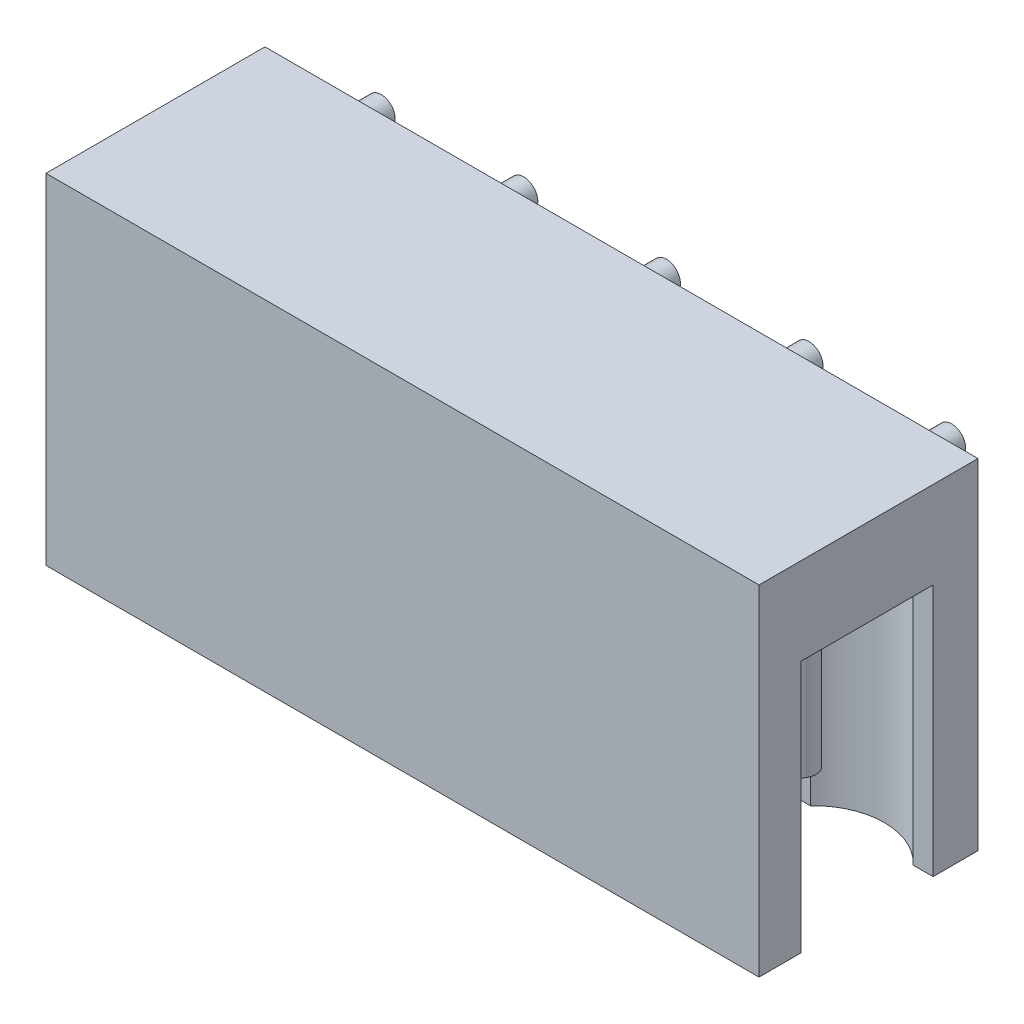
ISO-10303-21;
HEADER;
FILE_DESCRIPTION(('STEP AP214'),'2;1');
FILE_NAME('part.step','',(''),(''),'','','');
FILE_SCHEMA(('AUTOMOTIVE_DESIGN { 1 0 10303 214 1 1 1 1 }'));
ENDSEC;
DATA;
#1=APPLICATION_CONTEXT('core data for automotive mechanical design processes');
#2=APPLICATION_PROTOCOL_DEFINITION('international standard','automotive_design',2000,#1);
#3=PRODUCT_CONTEXT('',#1,'mechanical');
#4=PRODUCT('Part','Part','',(#3));
#5=PRODUCT_RELATED_PRODUCT_CATEGORY('part','',(#4));
#6=PRODUCT_DEFINITION_FORMATION('','',#4);
#7=PRODUCT_DEFINITION_CONTEXT('part definition',#1,'design');
#8=PRODUCT_DEFINITION('design','',#6,#7);
#9=PRODUCT_DEFINITION_SHAPE('','',#8);
#10=(LENGTH_UNIT() NAMED_UNIT(*) SI_UNIT(.MILLI.,.METRE.));
#11=(NAMED_UNIT(*) PLANE_ANGLE_UNIT() SI_UNIT($,.RADIAN.));
#12=(NAMED_UNIT(*) SI_UNIT($,.STERADIAN.) SOLID_ANGLE_UNIT());
#13=UNCERTAINTY_MEASURE_WITH_UNIT(LENGTH_MEASURE(1.E-05),#10,'distance_accuracy_value','');
#14=(GEOMETRIC_REPRESENTATION_CONTEXT(3) GLOBAL_UNCERTAINTY_ASSIGNED_CONTEXT((#13)) GLOBAL_UNIT_ASSIGNED_CONTEXT((#10,
#11,#12)) REPRESENTATION_CONTEXT('',''));
#15=CARTESIAN_POINT('',(0.,0.,0.));
#16=DIRECTION('',(0.,0.,1.));
#17=DIRECTION('',(1.,0.,0.));
#18=AXIS2_PLACEMENT_3D('',#15,#16,#17);
#19=CARTESIAN_POINT('',(0.,0.,7.8));
#20=DIRECTION('',(0.,1.,0.));
#21=DIRECTION('',(0.,0.,1.));
#22=AXIS2_PLACEMENT_3D('',#19,#20,#21);
#23=PLANE('',#22);
#24=DIRECTION('',(0.,0.,-1.));
#25=VECTOR('',#24,1.);
#26=CARTESIAN_POINT('',(0.,0.,7.8));
#27=LINE('',#26,#25);
#28=CARTESIAN_POINT('',(0.,0.,7.8));
#29=VERTEX_POINT('',#28);
#30=CARTESIAN_POINT('',(0.,0.,6.3));
#31=VERTEX_POINT('',#30);
#32=EDGE_CURVE('E11',#29,#31,#27,.T.);
#33=ORIENTED_EDGE('',*,*,#32,.T.);
#34=DIRECTION('',(-1.,0.,0.));
#35=VECTOR('',#34,1.);
#36=CARTESIAN_POINT('',(25.4,0.,6.3));
#37=LINE('',#36,#35);
#38=CARTESIAN_POINT('',(25.4,0.,6.3));
#39=VERTEX_POINT('',#38);
#40=EDGE_CURVE('E234',#39,#31,#37,.T.);
#41=ORIENTED_EDGE('',*,*,#40,.F.);
#42=DIRECTION('',(0.,0.,-1.));
#43=VECTOR('',#42,1.);
#44=CARTESIAN_POINT('',(25.4,0.,7.8));
#45=LINE('',#44,#43);
#46=CARTESIAN_POINT('',(25.4,0.,7.8));
#47=VERTEX_POINT('',#46);
#48=EDGE_CURVE('E334',#47,#39,#45,.T.);
#49=ORIENTED_EDGE('',*,*,#48,.F.);
#50=DIRECTION('',(1.,0.,0.));
#51=VECTOR('',#50,1.);
#52=CARTESIAN_POINT('',(0.,0.,7.8));
#53=LINE('',#52,#51);
#54=EDGE_CURVE('E87',#29,#47,#53,.T.);
#55=ORIENTED_EDGE('',*,*,#54,.F.);
#56=EDGE_LOOP('',(#33,#41,#49,#55));
#57=FACE_BOUND('',#56,.T.);
#58=ADVANCED_FACE('F35',(#57),#23,.F.);
#59=CARTESIAN_POINT('',(0.,0.,7.8));
#60=DIRECTION('',(1.,0.,0.));
#61=DIRECTION('',(0.,0.,-1.));
#62=AXIS2_PLACEMENT_3D('',#59,#60,#61);
#63=PLANE('',#62);
#64=CARTESIAN_POINT('',(0.,0.,1.6));
#65=VERTEX_POINT('',#64);
#66=CARTESIAN_POINT('',(0.,0.,0.));
#67=VERTEX_POINT('',#66);
#68=EDGE_CURVE('E43',#65,#67,#27,.T.);
#69=ORIENTED_EDGE('',*,*,#68,.F.);
#70=DIRECTION('',(0.,-1.,0.));
#71=VECTOR('',#70,1.);
#72=CARTESIAN_POINT('',(0.,9.,1.6));
#73=LINE('',#72,#71);
#74=CARTESIAN_POINT('',(0.,9.,1.6));
#75=VERTEX_POINT('',#74);
#76=EDGE_CURVE('E278',#75,#65,#73,.T.);
#77=ORIENTED_EDGE('',*,*,#76,.F.);
#78=DIRECTION('',(0.,0.,-1.));
#79=VECTOR('',#78,1.);
#80=CARTESIAN_POINT('',(0.,9.,6.3));
#81=LINE('',#80,#79);
#82=CARTESIAN_POINT('',(0.,9.,6.3));
#83=VERTEX_POINT('',#82);
#84=EDGE_CURVE('E203',#83,#75,#81,.T.);
#85=ORIENTED_EDGE('',*,*,#84,.F.);
#86=DIRECTION('',(0.,-1.,0.));
#87=VECTOR('',#86,1.);
#88=CARTESIAN_POINT('',(0.,9.,6.3));
#89=LINE('',#88,#87);
#90=EDGE_CURVE('E280',#83,#31,#89,.T.);
#91=ORIENTED_EDGE('',*,*,#90,.T.);
#92=ORIENTED_EDGE('',*,*,#32,.F.);
#93=DIRECTION('',(0.,-1.,0.));
#94=VECTOR('',#93,1.);
#95=CARTESIAN_POINT('',(0.,0.,7.8));
#96=LINE('',#95,#94);
#97=CARTESIAN_POINT('',(0.,12.1,7.8));
#98=VERTEX_POINT('',#97);
#99=EDGE_CURVE('E316',#98,#29,#96,.T.);
#100=ORIENTED_EDGE('',*,*,#99,.F.);
#101=DIRECTION('',(0.,0.,-1.));
#102=VECTOR('',#101,1.);
#103=CARTESIAN_POINT('',(0.,12.1,7.8));
#104=LINE('',#103,#102);
#105=CARTESIAN_POINT('',(0.,12.1,0.));
#106=VERTEX_POINT('',#105);
#107=EDGE_CURVE('E322',#98,#106,#104,.T.);
#108=ORIENTED_EDGE('',*,*,#107,.T.);
#109=DIRECTION('',(0.,-1.,0.));
#110=VECTOR('',#109,1.);
#111=CARTESIAN_POINT('',(0.,0.,0.));
#112=LINE('',#111,#110);
#113=EDGE_CURVE('E313',#106,#67,#112,.T.);
#114=ORIENTED_EDGE('',*,*,#113,.T.);
#115=EDGE_LOOP('',(#69,#77,#85,#91,#92,#100,#108,#114));
#116=FACE_BOUND('',#115,.T.);
#117=ADVANCED_FACE('F37',(#116),#63,.F.);
#118=CARTESIAN_POINT('',(2.54,0.,3.29999999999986));
#119=DIRECTION('',(0.,-1.,0.));
#120=DIRECTION('',(0.,0.,-1.));
#121=AXIS2_PLACEMENT_3D('',#118,#119,#120);
#122=CIRCLE('',#121,2.5);
#123=CARTESIAN_POINT('',(0.706969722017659,0.,1.59999999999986));
#124=VERTEX_POINT('',#123);
#125=CARTESIAN_POINT('',(4.37303027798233,0.,1.59999999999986));
#126=VERTEX_POINT('',#125);
#127=EDGE_CURVE('E239',#124,#126,#122,.T.);
#128=ORIENTED_EDGE('',*,*,#127,.F.);
#129=DIRECTION('',(1.,0.,-2.00286942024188E-13));
#130=VECTOR('',#129,1.);
#131=CARTESIAN_POINT('',(0.,0.,1.6));
#132=LINE('',#131,#130);
#133=EDGE_CURVE('E236',#65,#124,#132,.T.);
#134=ORIENTED_EDGE('',*,*,#133,.F.);
#135=ORIENTED_EDGE('',*,*,#68,.T.);
#136=DIRECTION('',(1.,0.,0.));
#137=VECTOR('',#136,1.);
#138=CARTESIAN_POINT('',(0.,0.,0.));
#139=LINE('',#138,#137);
#140=CARTESIAN_POINT('',(25.4,0.,0.));
#141=VERTEX_POINT('',#140);
#142=EDGE_CURVE('E325',#67,#141,#139,.T.);
#143=ORIENTED_EDGE('',*,*,#142,.T.);
#144=CARTESIAN_POINT('',(25.4,0.,1.6));
#145=VERTEX_POINT('',#144);
#146=EDGE_CURVE('E333',#145,#141,#45,.T.);
#147=ORIENTED_EDGE('',*,*,#146,.F.);
#148=DIRECTION('',(1.,0.,0.));
#149=VECTOR('',#148,1.);
#150=CARTESIAN_POINT('',(24.6930302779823,0.,1.6));
#151=LINE('',#150,#149);
#152=CARTESIAN_POINT('',(24.6930302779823,0.,1.6));
#153=VERTEX_POINT('',#152);
#154=EDGE_CURVE('E231',#153,#145,#151,.T.);
#155=ORIENTED_EDGE('',*,*,#154,.F.);
#156=CARTESIAN_POINT('',(22.86,0.,3.3));
#157=DIRECTION('',(0.,-1.,0.));
#158=DIRECTION('',(0.,0.,-1.));
#159=AXIS2_PLACEMENT_3D('',#156,#157,#158);
#160=CIRCLE('',#159,2.5);
#161=CARTESIAN_POINT('',(21.0269697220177,0.,1.6));
#162=VERTEX_POINT('',#161);
#163=EDGE_CURVE('E176',#162,#153,#160,.T.);
#164=ORIENTED_EDGE('',*,*,#163,.F.);
#165=DIRECTION('',(1.,0.,0.));
#166=VECTOR('',#165,1.);
#167=CARTESIAN_POINT('',(19.6130302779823,0.,1.59999999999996));
#168=LINE('',#167,#166);
#169=CARTESIAN_POINT('',(19.6130302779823,0.,1.59999999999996));
#170=VERTEX_POINT('',#169);
#171=EDGE_CURVE('E190',#170,#162,#168,.T.);
#172=ORIENTED_EDGE('',*,*,#171,.F.);
#173=CARTESIAN_POINT('',(17.78,0.,3.29999999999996));
#174=DIRECTION('',(0.,-1.,0.));
#175=DIRECTION('',(0.,0.,-1.));
#176=AXIS2_PLACEMENT_3D('',#173,#174,#175);
#177=CIRCLE('',#176,2.5);
#178=CARTESIAN_POINT('',(15.9469697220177,0.,1.59999999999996));
#179=VERTEX_POINT('',#178);
#180=EDGE_CURVE('E193',#179,#170,#177,.T.);
#181=ORIENTED_EDGE('',*,*,#180,.F.);
#182=DIRECTION('',(1.,0.,0.));
#183=VECTOR('',#182,1.);
#184=CARTESIAN_POINT('',(14.5330302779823,0.,1.59999999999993));
#185=LINE('',#184,#183);
#186=CARTESIAN_POINT('',(14.5330302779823,0.,1.59999999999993));
#187=VERTEX_POINT('',#186);
#188=EDGE_CURVE('E254',#187,#179,#185,.T.);
#189=ORIENTED_EDGE('',*,*,#188,.F.);
#190=CARTESIAN_POINT('',(12.7,0.,3.29999999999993));
#191=DIRECTION('',(0.,-1.,0.));
#192=DIRECTION('',(0.,0.,-1.));
#193=AXIS2_PLACEMENT_3D('',#190,#191,#192);
#194=CIRCLE('',#193,2.5);
#195=CARTESIAN_POINT('',(10.8669697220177,0.,1.59999999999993));
#196=VERTEX_POINT('',#195);
#197=EDGE_CURVE('E251',#196,#187,#194,.T.);
#198=ORIENTED_EDGE('',*,*,#197,.F.);
#199=DIRECTION('',(1.,0.,0.));
#200=VECTOR('',#199,1.);
#201=CARTESIAN_POINT('',(9.45303027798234,0.,1.59999999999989));
#202=LINE('',#201,#200);
#203=CARTESIAN_POINT('',(9.45303027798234,0.,1.59999999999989));
#204=VERTEX_POINT('',#203);
#205=EDGE_CURVE('E248',#204,#196,#202,.T.);
#206=ORIENTED_EDGE('',*,*,#205,.F.);
#207=CARTESIAN_POINT('',(7.62,0.,3.29999999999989));
#208=DIRECTION('',(0.,-1.,0.));
#209=DIRECTION('',(0.,0.,-1.));
#210=AXIS2_PLACEMENT_3D('',#207,#208,#209);
#211=CIRCLE('',#210,2.5);
#212=CARTESIAN_POINT('',(5.78696972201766,0.,1.59999999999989));
#213=VERTEX_POINT('',#212);
#214=EDGE_CURVE('E245',#213,#204,#211,.T.);
#215=ORIENTED_EDGE('',*,*,#214,.F.);
#216=DIRECTION('',(1.,0.,0.));
#217=VECTOR('',#216,1.);
#218=CARTESIAN_POINT('',(4.37303027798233,0.,1.59999999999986));
#219=LINE('',#218,#217);
#220=EDGE_CURVE('E242',#126,#213,#219,.T.);
#221=ORIENTED_EDGE('',*,*,#220,.F.);
#222=EDGE_LOOP('',(#128,#134,#135,#143,#147,#155,#164,#172,#181,#189,#198,#206,#215,#221));
#223=FACE_BOUND('',#222,.T.);
#224=ADVANCED_FACE('F346',(#223),#23,.F.);
#225=CARTESIAN_POINT('',(25.4,0.,7.8));
#226=DIRECTION('',(-1.,0.,0.));
#227=DIRECTION('',(0.,0.,1.));
#228=AXIS2_PLACEMENT_3D('',#225,#226,#227);
#229=PLANE('',#228);
#230=ORIENTED_EDGE('',*,*,#48,.T.);
#231=DIRECTION('',(0.,-1.,0.));
#232=VECTOR('',#231,1.);
#233=CARTESIAN_POINT('',(25.4,9.,6.3));
#234=LINE('',#233,#232);
#235=CARTESIAN_POINT('',(25.4,9.,6.3));
#236=VERTEX_POINT('',#235);
#237=EDGE_CURVE('E283',#236,#39,#234,.T.);
#238=ORIENTED_EDGE('',*,*,#237,.F.);
#239=DIRECTION('',(0.,0.,1.));
#240=VECTOR('',#239,1.);
#241=CARTESIAN_POINT('',(25.4,9.,1.6));
#242=LINE('',#241,#240);
#243=CARTESIAN_POINT('',(25.4,9.,1.6));
#244=VERTEX_POINT('',#243);
#245=EDGE_CURVE('E185',#244,#236,#242,.T.);
#246=ORIENTED_EDGE('',*,*,#245,.F.);
#247=DIRECTION('',(0.,-1.,0.));
#248=VECTOR('',#247,1.);
#249=CARTESIAN_POINT('',(25.4,9.,1.6));
#250=LINE('',#249,#248);
#251=EDGE_CURVE('E179',#244,#145,#250,.T.);
#252=ORIENTED_EDGE('',*,*,#251,.T.);
#253=ORIENTED_EDGE('',*,*,#146,.T.);
#254=DIRECTION('',(0.,1.,0.));
#255=VECTOR('',#254,1.);
#256=CARTESIAN_POINT('',(25.4,0.,0.));
#257=LINE('',#256,#255);
#258=CARTESIAN_POINT('',(25.4,12.1,0.));
#259=VERTEX_POINT('',#258);
#260=EDGE_CURVE('E328',#141,#259,#257,.T.);
#261=ORIENTED_EDGE('',*,*,#260,.T.);
#262=DIRECTION('',(0.,0.,-1.));
#263=VECTOR('',#262,1.);
#264=CARTESIAN_POINT('',(25.4,12.1,7.8));
#265=LINE('',#264,#263);
#266=CARTESIAN_POINT('',(25.4,12.1,7.8));
#267=VERTEX_POINT('',#266);
#268=EDGE_CURVE('E332',#267,#259,#265,.T.);
#269=ORIENTED_EDGE('',*,*,#268,.F.);
#270=DIRECTION('',(0.,1.,0.));
#271=VECTOR('',#270,1.);
#272=CARTESIAN_POINT('',(25.4,0.,7.8));
#273=LINE('',#272,#271);
#274=EDGE_CURVE('E319',#47,#267,#273,.T.);
#275=ORIENTED_EDGE('',*,*,#274,.F.);
#276=EDGE_LOOP('',(#230,#238,#246,#252,#253,#261,#269,#275));
#277=FACE_BOUND('',#276,.T.);
#278=ADVANCED_FACE('F340',(#277),#229,.F.);
#279=CARTESIAN_POINT('',(0.,12.1,7.8));
#280=DIRECTION('',(0.,-1.,0.));
#281=DIRECTION('',(0.,0.,-1.));
#282=AXIS2_PLACEMENT_3D('',#279,#280,#281);
#283=PLANE('',#282);
#284=DIRECTION('',(-1.,0.,0.));
#285=VECTOR('',#284,1.);
#286=CARTESIAN_POINT('',(0.,12.1,0.));
#287=LINE('',#286,#285);
#288=EDGE_CURVE('E80',#259,#106,#287,.T.);
#289=ORIENTED_EDGE('',*,*,#288,.T.);
#290=ORIENTED_EDGE('',*,*,#107,.F.);
#291=DIRECTION('',(-1.,0.,0.));
#292=VECTOR('',#291,1.);
#293=CARTESIAN_POINT('',(0.,12.1,7.8));
#294=LINE('',#293,#292);
#295=EDGE_CURVE('E59',#267,#98,#294,.T.);
#296=ORIENTED_EDGE('',*,*,#295,.F.);
#297=ORIENTED_EDGE('',*,*,#268,.T.);
#298=EDGE_LOOP('',(#289,#290,#296,#297));
#299=FACE_BOUND('',#298,.T.);
#300=ADVANCED_FACE('F356',(#299),#283,.F.);
#301=CARTESIAN_POINT('',(0.,0.,7.8));
#302=DIRECTION('',(0.,0.,-1.));
#303=DIRECTION('',(-1.,0.,0.));
#304=AXIS2_PLACEMENT_3D('',#301,#302,#303);
#305=PLANE('',#304);
#306=ORIENTED_EDGE('',*,*,#99,.T.);
#307=ORIENTED_EDGE('',*,*,#54,.T.);
#308=ORIENTED_EDGE('',*,*,#274,.T.);
#309=ORIENTED_EDGE('',*,*,#295,.T.);
#310=EDGE_LOOP('',(#306,#307,#308,#309));
#311=FACE_BOUND('',#310,.T.);
#312=ADVANCED_FACE('F357',(#311),#305,.F.);
#313=CARTESIAN_POINT('',(0.,0.,0.));
#314=DIRECTION('',(0.,0.,-1.));
#315=DIRECTION('',(-1.,0.,0.));
#316=AXIS2_PLACEMENT_3D('',#313,#314,#315);
#317=PLANE('',#316);
#318=CARTESIAN_POINT('',(22.86,10.5999999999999,0.));
#319=DIRECTION('',(0.,0.,-1.));
#320=DIRECTION('',(-1.,0.,0.));
#321=AXIS2_PLACEMENT_3D('',#318,#319,#320);
#322=CIRCLE('',#321,0.500000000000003);
#323=CARTESIAN_POINT('',(22.36,10.5999999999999,0.));
#324=VERTEX_POINT('',#323);
#325=EDGE_CURVE('E261',#324,#324,#322,.T.);
#326=ORIENTED_EDGE('',*,*,#325,.F.);
#327=EDGE_LOOP('',(#326));
#328=FACE_BOUND('',#327,.T.);
#329=CARTESIAN_POINT('',(17.78,10.5999999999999,0.));
#330=DIRECTION('',(0.,0.,-1.));
#331=DIRECTION('',(-1.,0.,0.));
#332=AXIS2_PLACEMENT_3D('',#329,#330,#331);
#333=CIRCLE('',#332,0.500000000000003);
#334=CARTESIAN_POINT('',(17.28,10.5999999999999,0.));
#335=VERTEX_POINT('',#334);
#336=EDGE_CURVE('E289',#335,#335,#333,.T.);
#337=ORIENTED_EDGE('',*,*,#336,.F.);
#338=EDGE_LOOP('',(#337));
#339=FACE_BOUND('',#338,.T.);
#340=CARTESIAN_POINT('',(12.7,10.5999999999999,0.));
#341=DIRECTION('',(0.,0.,-1.));
#342=DIRECTION('',(-1.,0.,0.));
#343=AXIS2_PLACEMENT_3D('',#340,#341,#342);
#344=CIRCLE('',#343,0.499999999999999);
#345=CARTESIAN_POINT('',(12.2,10.5999999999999,0.));
#346=VERTEX_POINT('',#345);
#347=EDGE_CURVE('E295',#346,#346,#344,.T.);
#348=ORIENTED_EDGE('',*,*,#347,.F.);
#349=EDGE_LOOP('',(#348));
#350=FACE_BOUND('',#349,.T.);
#351=CARTESIAN_POINT('',(7.62,10.6,0.));
#352=DIRECTION('',(0.,0.,-1.));
#353=DIRECTION('',(-1.,0.,0.));
#354=AXIS2_PLACEMENT_3D('',#351,#352,#353);
#355=CIRCLE('',#354,0.5);
#356=CARTESIAN_POINT('',(7.12,10.6,0.));
#357=VERTEX_POINT('',#356);
#358=EDGE_CURVE('E301',#357,#357,#355,.T.);
#359=ORIENTED_EDGE('',*,*,#358,.F.);
#360=EDGE_LOOP('',(#359));
#361=FACE_BOUND('',#360,.T.);
#362=CARTESIAN_POINT('',(2.54,10.6,0.));
#363=DIRECTION('',(0.,0.,-1.));
#364=DIRECTION('',(-1.,0.,0.));
#365=AXIS2_PLACEMENT_3D('',#362,#363,#364);
#366=CIRCLE('',#365,0.5);
#367=CARTESIAN_POINT('',(2.04,10.6,0.));
#368=VERTEX_POINT('',#367);
#369=EDGE_CURVE('E307',#368,#368,#366,.T.);
#370=ORIENTED_EDGE('',*,*,#369,.F.);
#371=EDGE_LOOP('',(#370));
#372=FACE_BOUND('',#371,.T.);
#373=ORIENTED_EDGE('',*,*,#113,.F.);
#374=ORIENTED_EDGE('',*,*,#288,.F.);
#375=ORIENTED_EDGE('',*,*,#260,.F.);
#376=ORIENTED_EDGE('',*,*,#142,.F.);
#377=EDGE_LOOP('',(#373,#374,#375,#376));
#378=FACE_BOUND('',#377,.T.);
#379=ADVANCED_FACE('F351',(#328,#339,#350,#361,#372,#378),#317,.T.);
#380=CARTESIAN_POINT('',(2.54,10.6,-1.6));
#381=DIRECTION('',(0.,0.,1.));
#382=DIRECTION('',(1.,0.,0.));
#383=AXIS2_PLACEMENT_3D('',#380,#381,#382);
#384=CYLINDRICAL_SURFACE('',#383,0.5);
#385=CARTESIAN_POINT('',(2.54,10.6,-1.6));
#386=DIRECTION('',(0.,0.,-1.));
#387=DIRECTION('',(-1.,0.,0.));
#388=AXIS2_PLACEMENT_3D('',#385,#386,#387);
#389=CIRCLE('',#388,0.5);
#390=CARTESIAN_POINT('',(2.04,10.6,-1.6));
#391=VERTEX_POINT('',#390);
#392=EDGE_CURVE('E310',#391,#391,#389,.T.);
#393=ORIENTED_EDGE('',*,*,#392,.F.);
#394=EDGE_LOOP('',(#393));
#395=FACE_BOUND('',#394,.T.);
#396=ORIENTED_EDGE('',*,*,#369,.T.);
#397=EDGE_LOOP('',(#396));
#398=FACE_BOUND('',#397,.T.);
#399=ADVANCED_FACE('F420',(#395,#398),#384,.T.);
#400=CARTESIAN_POINT('',(2.54,10.6,-1.6));
#401=DIRECTION('',(0.,0.,-1.));
#402=DIRECTION('',(-1.,0.,0.));
#403=AXIS2_PLACEMENT_3D('',#400,#401,#402);
#404=PLANE('',#403);
#405=ORIENTED_EDGE('',*,*,#392,.T.);
#406=EDGE_LOOP('',(#405));
#407=FACE_BOUND('',#406,.T.);
#408=ADVANCED_FACE('F426',(#407),#404,.T.);
#409=CARTESIAN_POINT('',(7.62,10.6,-1.6));
#410=DIRECTION('',(0.,0.,1.));
#411=DIRECTION('',(1.,0.,0.));
#412=AXIS2_PLACEMENT_3D('',#409,#410,#411);
#413=CYLINDRICAL_SURFACE('',#412,0.5);
#414=CARTESIAN_POINT('',(7.62,10.6,-1.6));
#415=DIRECTION('',(0.,0.,-1.));
#416=DIRECTION('',(-1.,0.,0.));
#417=AXIS2_PLACEMENT_3D('',#414,#415,#416);
#418=CIRCLE('',#417,0.5);
#419=CARTESIAN_POINT('',(7.12,10.6,-1.6));
#420=VERTEX_POINT('',#419);
#421=EDGE_CURVE('E304',#420,#420,#418,.T.);
#422=ORIENTED_EDGE('',*,*,#421,.F.);
#423=EDGE_LOOP('',(#422));
#424=FACE_BOUND('',#423,.T.);
#425=ORIENTED_EDGE('',*,*,#358,.T.);
#426=EDGE_LOOP('',(#425));
#427=FACE_BOUND('',#426,.T.);
#428=ADVANCED_FACE('F430',(#424,#427),#413,.T.);
#429=CARTESIAN_POINT('',(7.62,10.6,-1.6));
#430=DIRECTION('',(0.,0.,-1.));
#431=DIRECTION('',(-1.,0.,0.));
#432=AXIS2_PLACEMENT_3D('',#429,#430,#431);
#433=PLANE('',#432);
#434=ORIENTED_EDGE('',*,*,#421,.T.);
#435=EDGE_LOOP('',(#434));
#436=FACE_BOUND('',#435,.T.);
#437=ADVANCED_FACE('F434',(#436),#433,.T.);
#438=CARTESIAN_POINT('',(12.7,10.5999999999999,-1.6));
#439=DIRECTION('',(0.,0.,1.));
#440=DIRECTION('',(1.,0.,0.));
#441=AXIS2_PLACEMENT_3D('',#438,#439,#440);
#442=CYLINDRICAL_SURFACE('',#441,0.499999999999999);
#443=CARTESIAN_POINT('',(12.7,10.5999999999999,-1.6));
#444=DIRECTION('',(0.,0.,-1.));
#445=DIRECTION('',(-1.,0.,0.));
#446=AXIS2_PLACEMENT_3D('',#443,#444,#445);
#447=CIRCLE('',#446,0.499999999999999);
#448=CARTESIAN_POINT('',(12.2,10.5999999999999,-1.6));
#449=VERTEX_POINT('',#448);
#450=EDGE_CURVE('E298',#449,#449,#447,.T.);
#451=ORIENTED_EDGE('',*,*,#450,.F.);
#452=EDGE_LOOP('',(#451));
#453=FACE_BOUND('',#452,.T.);
#454=ORIENTED_EDGE('',*,*,#347,.T.);
#455=EDGE_LOOP('',(#454));
#456=FACE_BOUND('',#455,.T.);
#457=ADVANCED_FACE('F438',(#453,#456),#442,.T.);
#458=CARTESIAN_POINT('',(12.7,10.5999999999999,-1.6));
#459=DIRECTION('',(0.,0.,-1.));
#460=DIRECTION('',(-1.,0.,0.));
#461=AXIS2_PLACEMENT_3D('',#458,#459,#460);
#462=PLANE('',#461);
#463=ORIENTED_EDGE('',*,*,#450,.T.);
#464=EDGE_LOOP('',(#463));
#465=FACE_BOUND('',#464,.T.);
#466=ADVANCED_FACE('F442',(#465),#462,.T.);
#467=CARTESIAN_POINT('',(17.78,10.5999999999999,-1.6));
#468=DIRECTION('',(0.,0.,1.));
#469=DIRECTION('',(1.,0.,0.));
#470=AXIS2_PLACEMENT_3D('',#467,#468,#469);
#471=CYLINDRICAL_SURFACE('',#470,0.500000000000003);
#472=CARTESIAN_POINT('',(17.78,10.5999999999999,-1.6));
#473=DIRECTION('',(0.,0.,-1.));
#474=DIRECTION('',(-1.,0.,0.));
#475=AXIS2_PLACEMENT_3D('',#472,#473,#474);
#476=CIRCLE('',#475,0.500000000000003);
#477=CARTESIAN_POINT('',(17.28,10.5999999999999,-1.6));
#478=VERTEX_POINT('',#477);
#479=EDGE_CURVE('E292',#478,#478,#476,.T.);
#480=ORIENTED_EDGE('',*,*,#479,.F.);
#481=EDGE_LOOP('',(#480));
#482=FACE_BOUND('',#481,.T.);
#483=ORIENTED_EDGE('',*,*,#336,.T.);
#484=EDGE_LOOP('',(#483));
#485=FACE_BOUND('',#484,.T.);
#486=ADVANCED_FACE('F446',(#482,#485),#471,.T.);
#487=CARTESIAN_POINT('',(17.78,10.5999999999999,-1.6));
#488=DIRECTION('',(0.,0.,-1.));
#489=DIRECTION('',(-1.,0.,0.));
#490=AXIS2_PLACEMENT_3D('',#487,#488,#489);
#491=PLANE('',#490);
#492=ORIENTED_EDGE('',*,*,#479,.T.);
#493=EDGE_LOOP('',(#492));
#494=FACE_BOUND('',#493,.T.);
#495=ADVANCED_FACE('F450',(#494),#491,.T.);
#496=CARTESIAN_POINT('',(22.86,10.5999999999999,-1.6));
#497=DIRECTION('',(0.,0.,1.));
#498=DIRECTION('',(1.,0.,0.));
#499=AXIS2_PLACEMENT_3D('',#496,#497,#498);
#500=CYLINDRICAL_SURFACE('',#499,0.500000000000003);
#501=CARTESIAN_POINT('',(22.86,10.5999999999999,-1.6));
#502=DIRECTION('',(0.,0.,-1.));
#503=DIRECTION('',(-1.,0.,0.));
#504=AXIS2_PLACEMENT_3D('',#501,#502,#503);
#505=CIRCLE('',#504,0.500000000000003);
#506=CARTESIAN_POINT('',(22.36,10.5999999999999,-1.6));
#507=VERTEX_POINT('',#506);
#508=EDGE_CURVE('E286',#507,#507,#505,.T.);
#509=ORIENTED_EDGE('',*,*,#508,.F.);
#510=EDGE_LOOP('',(#509));
#511=FACE_BOUND('',#510,.T.);
#512=ORIENTED_EDGE('',*,*,#325,.T.);
#513=EDGE_LOOP('',(#512));
#514=FACE_BOUND('',#513,.T.);
#515=ADVANCED_FACE('F454',(#511,#514),#500,.T.);
#516=CARTESIAN_POINT('',(22.86,10.5999999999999,-1.6));
#517=DIRECTION('',(0.,0.,-1.));
#518=DIRECTION('',(-1.,0.,0.));
#519=AXIS2_PLACEMENT_3D('',#516,#517,#518);
#520=PLANE('',#519);
#521=ORIENTED_EDGE('',*,*,#508,.T.);
#522=EDGE_LOOP('',(#521));
#523=FACE_BOUND('',#522,.T.);
#524=ADVANCED_FACE('F401',(#523),#520,.T.);
#525=CARTESIAN_POINT('',(22.86,9.,3.3));
#526=DIRECTION('',(0.,-1.,0.));
#527=DIRECTION('',(0.,0.,-1.));
#528=AXIS2_PLACEMENT_3D('',#525,#526,#527);
#529=CYLINDRICAL_SURFACE('',#528,2.5);
#530=ORIENTED_EDGE('',*,*,#163,.T.);
#531=DIRECTION('',(0.,-1.,0.));
#532=VECTOR('',#531,1.);
#533=CARTESIAN_POINT('',(24.6930302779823,9.,1.6));
#534=LINE('',#533,#532);
#535=CARTESIAN_POINT('',(24.6930302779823,9.,1.6));
#536=VERTEX_POINT('',#535);
#537=EDGE_CURVE('E171',#536,#153,#534,.T.);
#538=ORIENTED_EDGE('',*,*,#537,.F.);
#539=CARTESIAN_POINT('',(22.86,9.,3.3));
#540=DIRECTION('',(0.,-1.,0.));
#541=DIRECTION('',(0.,0.,-1.));
#542=AXIS2_PLACEMENT_3D('',#539,#540,#541);
#543=CIRCLE('',#542,2.5);
#544=CARTESIAN_POINT('',(21.0269697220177,9.,1.6));
#545=VERTEX_POINT('',#544);
#546=EDGE_CURVE('E173',#545,#536,#543,.T.);
#547=ORIENTED_EDGE('',*,*,#546,.F.);
#548=DIRECTION('',(0.,-1.,0.));
#549=VECTOR('',#548,1.);
#550=CARTESIAN_POINT('',(21.0269697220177,9.,1.6));
#551=LINE('',#550,#549);
#552=EDGE_CURVE('E259',#545,#162,#551,.T.);
#553=ORIENTED_EDGE('',*,*,#552,.T.);
#554=EDGE_LOOP('',(#530,#538,#547,#553));
#555=FACE_BOUND('',#554,.T.);
#556=ADVANCED_FACE('F172',(#555),#529,.F.);
#557=CARTESIAN_POINT('',(19.6130302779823,9.,1.59999999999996));
#558=DIRECTION('',(0.,0.,-1.));
#559=DIRECTION('',(-1.,0.,0.));
#560=AXIS2_PLACEMENT_3D('',#557,#558,#559);
#561=PLANE('',#560);
#562=ORIENTED_EDGE('',*,*,#171,.T.);
#563=ORIENTED_EDGE('',*,*,#552,.F.);
#564=DIRECTION('',(1.,0.,0.));
#565=VECTOR('',#564,1.);
#566=CARTESIAN_POINT('',(19.6130302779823,9.,1.59999999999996));
#567=LINE('',#566,#565);
#568=CARTESIAN_POINT('',(19.6130302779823,9.,1.59999999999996));
#569=VERTEX_POINT('',#568);
#570=EDGE_CURVE('E180',#569,#545,#567,.T.);
#571=ORIENTED_EDGE('',*,*,#570,.F.);
#572=DIRECTION('',(0.,-1.,0.));
#573=VECTOR('',#572,1.);
#574=CARTESIAN_POINT('',(19.6130302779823,9.,1.59999999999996));
#575=LINE('',#574,#573);
#576=EDGE_CURVE('E262',#569,#170,#575,.T.);
#577=ORIENTED_EDGE('',*,*,#576,.T.);
#578=EDGE_LOOP('',(#562,#563,#571,#577));
#579=FACE_BOUND('',#578,.T.);
#580=ADVANCED_FACE('F393',(#579),#561,.F.);
#581=CARTESIAN_POINT('',(17.78,9.,3.29999999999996));
#582=DIRECTION('',(0.,-1.,0.));
#583=DIRECTION('',(0.,0.,-1.));
#584=AXIS2_PLACEMENT_3D('',#581,#582,#583);
#585=CYLINDRICAL_SURFACE('',#584,2.5);
#586=ORIENTED_EDGE('',*,*,#180,.T.);
#587=ORIENTED_EDGE('',*,*,#576,.F.);
#588=CARTESIAN_POINT('',(17.78,9.,3.29999999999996));
#589=DIRECTION('',(0.,-1.,0.));
#590=DIRECTION('',(0.,0.,-1.));
#591=AXIS2_PLACEMENT_3D('',#588,#589,#590);
#592=CIRCLE('',#591,2.5);
#593=CARTESIAN_POINT('',(15.9469697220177,9.,1.59999999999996));
#594=VERTEX_POINT('',#593);
#595=EDGE_CURVE('E227',#594,#569,#592,.T.);
#596=ORIENTED_EDGE('',*,*,#595,.F.);
#597=DIRECTION('',(0.,-1.,0.));
#598=VECTOR('',#597,1.);
#599=CARTESIAN_POINT('',(15.9469697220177,9.,1.59999999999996));
#600=LINE('',#599,#598);
#601=EDGE_CURVE('E264',#594,#179,#600,.T.);
#602=ORIENTED_EDGE('',*,*,#601,.T.);
#603=EDGE_LOOP('',(#586,#587,#596,#602));
#604=FACE_BOUND('',#603,.T.);
#605=ADVANCED_FACE('F390',(#604),#585,.F.);
#606=CARTESIAN_POINT('',(14.5330302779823,9.,1.59999999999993));
#607=DIRECTION('',(0.,0.,-1.));
#608=DIRECTION('',(-1.,0.,0.));
#609=AXIS2_PLACEMENT_3D('',#606,#607,#608);
#610=PLANE('',#609);
#611=ORIENTED_EDGE('',*,*,#188,.T.);
#612=ORIENTED_EDGE('',*,*,#601,.F.);
#613=DIRECTION('',(1.,0.,0.));
#614=VECTOR('',#613,1.);
#615=CARTESIAN_POINT('',(14.5330302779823,9.,1.59999999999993));
#616=LINE('',#615,#614);
#617=CARTESIAN_POINT('',(14.5330302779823,9.,1.59999999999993));
#618=VERTEX_POINT('',#617);
#619=EDGE_CURVE('E224',#618,#594,#616,.T.);
#620=ORIENTED_EDGE('',*,*,#619,.F.);
#621=DIRECTION('',(0.,-1.,0.));
#622=VECTOR('',#621,1.);
#623=CARTESIAN_POINT('',(14.5330302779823,9.,1.59999999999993));
#624=LINE('',#623,#622);
#625=EDGE_CURVE('E266',#618,#187,#624,.T.);
#626=ORIENTED_EDGE('',*,*,#625,.T.);
#627=EDGE_LOOP('',(#611,#612,#620,#626));
#628=FACE_BOUND('',#627,.T.);
#629=ADVANCED_FACE('F386',(#628),#610,.F.);
#630=CARTESIAN_POINT('',(12.7,9.,3.29999999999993));
#631=DIRECTION('',(0.,-1.,0.));
#632=DIRECTION('',(0.,0.,-1.));
#633=AXIS2_PLACEMENT_3D('',#630,#631,#632);
#634=CYLINDRICAL_SURFACE('',#633,2.5);
#635=ORIENTED_EDGE('',*,*,#197,.T.);
#636=ORIENTED_EDGE('',*,*,#625,.F.);
#637=CARTESIAN_POINT('',(12.7,9.,3.29999999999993));
#638=DIRECTION('',(0.,-1.,0.));
#639=DIRECTION('',(0.,0.,-1.));
#640=AXIS2_PLACEMENT_3D('',#637,#638,#639);
#641=CIRCLE('',#640,2.5);
#642=CARTESIAN_POINT('',(10.8669697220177,9.,1.59999999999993));
#643=VERTEX_POINT('',#642);
#644=EDGE_CURVE('E221',#643,#618,#641,.T.);
#645=ORIENTED_EDGE('',*,*,#644,.F.);
#646=DIRECTION('',(0.,-1.,0.));
#647=VECTOR('',#646,1.);
#648=CARTESIAN_POINT('',(10.8669697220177,9.,1.59999999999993));
#649=LINE('',#648,#647);
#650=EDGE_CURVE('E268',#643,#196,#649,.T.);
#651=ORIENTED_EDGE('',*,*,#650,.T.);
#652=EDGE_LOOP('',(#635,#636,#645,#651));
#653=FACE_BOUND('',#652,.T.);
#654=ADVANCED_FACE('F382',(#653),#634,.F.);
#655=CARTESIAN_POINT('',(9.45303027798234,9.,1.59999999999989));
#656=DIRECTION('',(0.,0.,-1.));
#657=DIRECTION('',(-1.,0.,0.));
#658=AXIS2_PLACEMENT_3D('',#655,#656,#657);
#659=PLANE('',#658);
#660=ORIENTED_EDGE('',*,*,#205,.T.);
#661=ORIENTED_EDGE('',*,*,#650,.F.);
#662=DIRECTION('',(1.,0.,0.));
#663=VECTOR('',#662,1.);
#664=CARTESIAN_POINT('',(9.45303027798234,9.,1.59999999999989));
#665=LINE('',#664,#663);
#666=CARTESIAN_POINT('',(9.45303027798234,9.,1.59999999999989));
#667=VERTEX_POINT('',#666);
#668=EDGE_CURVE('E218',#667,#643,#665,.T.);
#669=ORIENTED_EDGE('',*,*,#668,.F.);
#670=DIRECTION('',(0.,-1.,0.));
#671=VECTOR('',#670,1.);
#672=CARTESIAN_POINT('',(9.45303027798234,9.,1.59999999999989));
#673=LINE('',#672,#671);
#674=EDGE_CURVE('E270',#667,#204,#673,.T.);
#675=ORIENTED_EDGE('',*,*,#674,.T.);
#676=EDGE_LOOP('',(#660,#661,#669,#675));
#677=FACE_BOUND('',#676,.T.);
#678=ADVANCED_FACE('F378',(#677),#659,.F.);
#679=CARTESIAN_POINT('',(7.62,9.,3.29999999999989));
#680=DIRECTION('',(0.,-1.,0.));
#681=DIRECTION('',(0.,0.,-1.));
#682=AXIS2_PLACEMENT_3D('',#679,#680,#681);
#683=CYLINDRICAL_SURFACE('',#682,2.5);
#684=ORIENTED_EDGE('',*,*,#214,.T.);
#685=ORIENTED_EDGE('',*,*,#674,.F.);
#686=CARTESIAN_POINT('',(7.62,9.,3.29999999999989));
#687=DIRECTION('',(0.,-1.,0.));
#688=DIRECTION('',(0.,0.,-1.));
#689=AXIS2_PLACEMENT_3D('',#686,#687,#688);
#690=CIRCLE('',#689,2.5);
#691=CARTESIAN_POINT('',(5.78696972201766,9.,1.59999999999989));
#692=VERTEX_POINT('',#691);
#693=EDGE_CURVE('E215',#692,#667,#690,.T.);
#694=ORIENTED_EDGE('',*,*,#693,.F.);
#695=DIRECTION('',(0.,-1.,0.));
#696=VECTOR('',#695,1.);
#697=CARTESIAN_POINT('',(5.78696972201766,9.,1.59999999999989));
#698=LINE('',#697,#696);
#699=EDGE_CURVE('E272',#692,#213,#698,.T.);
#700=ORIENTED_EDGE('',*,*,#699,.T.);
#701=EDGE_LOOP('',(#684,#685,#694,#700));
#702=FACE_BOUND('',#701,.T.);
#703=ADVANCED_FACE('F374',(#702),#683,.F.);
#704=CARTESIAN_POINT('',(4.37303027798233,9.,1.59999999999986));
#705=DIRECTION('',(0.,0.,-1.));
#706=DIRECTION('',(-1.,0.,0.));
#707=AXIS2_PLACEMENT_3D('',#704,#705,#706);
#708=PLANE('',#707);
#709=ORIENTED_EDGE('',*,*,#220,.T.);
#710=ORIENTED_EDGE('',*,*,#699,.F.);
#711=DIRECTION('',(1.,0.,0.));
#712=VECTOR('',#711,1.);
#713=CARTESIAN_POINT('',(4.37303027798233,9.,1.59999999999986));
#714=LINE('',#713,#712);
#715=CARTESIAN_POINT('',(4.37303027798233,9.,1.59999999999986));
#716=VERTEX_POINT('',#715);
#717=EDGE_CURVE('E212',#716,#692,#714,.T.);
#718=ORIENTED_EDGE('',*,*,#717,.F.);
#719=DIRECTION('',(0.,-1.,0.));
#720=VECTOR('',#719,1.);
#721=CARTESIAN_POINT('',(4.37303027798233,9.,1.59999999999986));
#722=LINE('',#721,#720);
#723=EDGE_CURVE('E274',#716,#126,#722,.T.);
#724=ORIENTED_EDGE('',*,*,#723,.T.);
#725=EDGE_LOOP('',(#709,#710,#718,#724));
#726=FACE_BOUND('',#725,.T.);
#727=ADVANCED_FACE('F370',(#726),#708,.F.);
#728=CARTESIAN_POINT('',(2.54,9.,3.29999999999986));
#729=DIRECTION('',(0.,-1.,0.));
#730=DIRECTION('',(0.,0.,-1.));
#731=AXIS2_PLACEMENT_3D('',#728,#729,#730);
#732=CYLINDRICAL_SURFACE('',#731,2.5);
#733=ORIENTED_EDGE('',*,*,#127,.T.);
#734=ORIENTED_EDGE('',*,*,#723,.F.);
#735=CARTESIAN_POINT('',(2.54,9.,3.29999999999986));
#736=DIRECTION('',(0.,-1.,0.));
#737=DIRECTION('',(0.,0.,-1.));
#738=AXIS2_PLACEMENT_3D('',#735,#736,#737);
#739=CIRCLE('',#738,2.5);
#740=CARTESIAN_POINT('',(0.706969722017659,9.,1.59999999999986));
#741=VERTEX_POINT('',#740);
#742=EDGE_CURVE('E209',#741,#716,#739,.T.);
#743=ORIENTED_EDGE('',*,*,#742,.F.);
#744=DIRECTION('',(0.,-1.,0.));
#745=VECTOR('',#744,1.);
#746=CARTESIAN_POINT('',(0.706969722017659,9.,1.59999999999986));
#747=LINE('',#746,#745);
#748=EDGE_CURVE('E276',#741,#124,#747,.T.);
#749=ORIENTED_EDGE('',*,*,#748,.T.);
#750=EDGE_LOOP('',(#733,#734,#743,#749));
#751=FACE_BOUND('',#750,.T.);
#752=ADVANCED_FACE('F366',(#751),#732,.F.);
#753=CARTESIAN_POINT('',(0.,9.,1.6));
#754=DIRECTION('',(-2.00286942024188E-13,0.,-1.));
#755=DIRECTION('',(-1.,0.,2.00286942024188E-13));
#756=AXIS2_PLACEMENT_3D('',#753,#754,#755);
#757=PLANE('',#756);
#758=ORIENTED_EDGE('',*,*,#133,.T.);
#759=ORIENTED_EDGE('',*,*,#748,.F.);
#760=DIRECTION('',(1.,0.,-2.00286942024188E-13));
#761=VECTOR('',#760,1.);
#762=CARTESIAN_POINT('',(0.,9.,1.6));
#763=LINE('',#762,#761);
#764=EDGE_CURVE('E206',#75,#741,#763,.T.);
#765=ORIENTED_EDGE('',*,*,#764,.F.);
#766=ORIENTED_EDGE('',*,*,#76,.T.);
#767=EDGE_LOOP('',(#758,#759,#765,#766));
#768=FACE_BOUND('',#767,.T.);
#769=ADVANCED_FACE('F364',(#768),#757,.F.);
#770=CARTESIAN_POINT('',(25.4,9.,6.3));
#771=DIRECTION('',(0.,0.,1.));
#772=DIRECTION('',(1.,0.,0.));
#773=AXIS2_PLACEMENT_3D('',#770,#771,#772);
#774=PLANE('',#773);
#775=ORIENTED_EDGE('',*,*,#40,.T.);
#776=ORIENTED_EDGE('',*,*,#90,.F.);
#777=DIRECTION('',(-1.,0.,0.));
#778=VECTOR('',#777,1.);
#779=CARTESIAN_POINT('',(25.4,9.,6.3));
#780=LINE('',#779,#778);
#781=EDGE_CURVE('E200',#236,#83,#780,.T.);
#782=ORIENTED_EDGE('',*,*,#781,.F.);
#783=ORIENTED_EDGE('',*,*,#237,.T.);
#784=EDGE_LOOP('',(#775,#776,#782,#783));
#785=FACE_BOUND('',#784,.T.);
#786=ADVANCED_FACE('F360',(#785),#774,.F.);
#787=CARTESIAN_POINT('',(24.6930302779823,9.,1.6));
#788=DIRECTION('',(0.,0.,-1.));
#789=DIRECTION('',(-1.,0.,0.));
#790=AXIS2_PLACEMENT_3D('',#787,#788,#789);
#791=PLANE('',#790);
#792=ORIENTED_EDGE('',*,*,#154,.T.);
#793=ORIENTED_EDGE('',*,*,#251,.F.);
#794=DIRECTION('',(1.,0.,0.));
#795=VECTOR('',#794,1.);
#796=CARTESIAN_POINT('',(24.6930302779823,9.,1.6));
#797=LINE('',#796,#795);
#798=EDGE_CURVE('E50',#536,#244,#797,.T.);
#799=ORIENTED_EDGE('',*,*,#798,.F.);
#800=ORIENTED_EDGE('',*,*,#537,.T.);
#801=EDGE_LOOP('',(#792,#793,#799,#800));
#802=FACE_BOUND('',#801,.T.);
#803=ADVANCED_FACE('F182',(#802),#791,.F.);
#804=CARTESIAN_POINT('',(22.86,9.,3.3));
#805=DIRECTION('',(0.,-1.,0.));
#806=DIRECTION('',(0.,0.,-1.));
#807=AXIS2_PLACEMENT_3D('',#804,#805,#806);
#808=PLANE('',#807);
#809=CARTESIAN_POINT('',(2.54,9.,3.73464617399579));
#810=DIRECTION('',(0.,-1.,0.));
#811=DIRECTION('',(0.,0.,-1.));
#812=AXIS2_PLACEMENT_3D('',#809,#810,#811);
#813=CIRCLE('',#812,0.499999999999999);
#814=CARTESIAN_POINT('',(2.54,9.,3.23464617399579));
#815=VERTEX_POINT('',#814);
#816=EDGE_CURVE('E797',#815,#815,#813,.T.);
#817=ORIENTED_EDGE('',*,*,#816,.F.);
#818=EDGE_LOOP('',(#817));
#819=FACE_BOUND('',#818,.T.);
#820=CARTESIAN_POINT('',(7.62,9.,3.73464617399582));
#821=DIRECTION('',(0.,-1.,0.));
#822=DIRECTION('',(0.,0.,-1.));
#823=AXIS2_PLACEMENT_3D('',#820,#821,#822);
#824=CIRCLE('',#823,0.499999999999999);
#825=CARTESIAN_POINT('',(7.62,9.,3.23464617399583));
#826=VERTEX_POINT('',#825);
#827=EDGE_CURVE('E796',#826,#826,#824,.T.);
#828=ORIENTED_EDGE('',*,*,#827,.F.);
#829=EDGE_LOOP('',(#828));
#830=FACE_BOUND('',#829,.T.);
#831=CARTESIAN_POINT('',(12.7,9.,3.73464617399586));
#832=DIRECTION('',(0.,-1.,0.));
#833=DIRECTION('',(0.,0.,-1.));
#834=AXIS2_PLACEMENT_3D('',#831,#832,#833);
#835=CIRCLE('',#834,0.499999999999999);
#836=CARTESIAN_POINT('',(12.7,9.,3.23464617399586));
#837=VERTEX_POINT('',#836);
#838=EDGE_CURVE('E806',#837,#837,#835,.T.);
#839=ORIENTED_EDGE('',*,*,#838,.F.);
#840=EDGE_LOOP('',(#839));
#841=FACE_BOUND('',#840,.T.);
#842=CARTESIAN_POINT('',(17.78,9.,3.7346461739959));
#843=DIRECTION('',(0.,-1.,0.));
#844=DIRECTION('',(0.,0.,-1.));
#845=AXIS2_PLACEMENT_3D('',#842,#843,#844);
#846=CIRCLE('',#845,0.499999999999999);
#847=CARTESIAN_POINT('',(17.78,9.,3.2346461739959));
#848=VERTEX_POINT('',#847);
#849=EDGE_CURVE('E811',#848,#848,#846,.T.);
#850=ORIENTED_EDGE('',*,*,#849,.F.);
#851=EDGE_LOOP('',(#850));
#852=FACE_BOUND('',#851,.T.);
#853=CARTESIAN_POINT('',(22.86,9.,3.73464617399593));
#854=DIRECTION('',(0.,-1.,0.));
#855=DIRECTION('',(0.,0.,-1.));
#856=AXIS2_PLACEMENT_3D('',#853,#854,#855);
#857=CIRCLE('',#856,0.499999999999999);
#858=CARTESIAN_POINT('',(22.86,9.,3.23464617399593));
#859=VERTEX_POINT('',#858);
#860=EDGE_CURVE('E196',#859,#859,#857,.T.);
#861=ORIENTED_EDGE('',*,*,#860,.F.);
#862=EDGE_LOOP('',(#861));
#863=FACE_BOUND('',#862,.T.);
#864=ORIENTED_EDGE('',*,*,#546,.T.);
#865=ORIENTED_EDGE('',*,*,#798,.T.);
#866=ORIENTED_EDGE('',*,*,#245,.T.);
#867=ORIENTED_EDGE('',*,*,#781,.T.);
#868=ORIENTED_EDGE('',*,*,#84,.T.);
#869=ORIENTED_EDGE('',*,*,#764,.T.);
#870=ORIENTED_EDGE('',*,*,#742,.T.);
#871=ORIENTED_EDGE('',*,*,#717,.T.);
#872=ORIENTED_EDGE('',*,*,#693,.T.);
#873=ORIENTED_EDGE('',*,*,#668,.T.);
#874=ORIENTED_EDGE('',*,*,#644,.T.);
#875=ORIENTED_EDGE('',*,*,#619,.T.);
#876=ORIENTED_EDGE('',*,*,#595,.T.);
#877=ORIENTED_EDGE('',*,*,#570,.T.);
#878=EDGE_LOOP('',(#864,#865,#866,#867,#868,#869,#870,#871,#872,#873,#874,#875,#876,#877));
#879=FACE_BOUND('',#878,.T.);
#880=ADVANCED_FACE('F187',(#819,#830,#841,#852,#863,#879),#808,.T.);
#881=CARTESIAN_POINT('',(22.86,3.2,3.73464617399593));
#882=DIRECTION('',(0.,1.,0.));
#883=DIRECTION('',(0.,0.,1.));
#884=AXIS2_PLACEMENT_3D('',#881,#882,#883);
#885=CYLINDRICAL_SURFACE('',#884,0.499999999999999);
#886=CARTESIAN_POINT('',(22.86,3.2,3.73464617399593));
#887=DIRECTION('',(0.,-1.,0.));
#888=DIRECTION('',(0.,0.,-1.));
#889=AXIS2_PLACEMENT_3D('',#886,#887,#888);
#890=CIRCLE('',#889,0.499999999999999);
#891=CARTESIAN_POINT('',(22.86,3.2,3.23464617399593));
#892=VERTEX_POINT('',#891);
#893=EDGE_CURVE('E232',#892,#892,#890,.T.);
#894=ORIENTED_EDGE('',*,*,#893,.F.);
#895=EDGE_LOOP('',(#894));
#896=FACE_BOUND('',#895,.T.);
#897=ORIENTED_EDGE('',*,*,#860,.T.);
#898=EDGE_LOOP('',(#897));
#899=FACE_BOUND('',#898,.T.);
#900=ADVANCED_FACE('F521',(#896,#899),#885,.T.);
#901=CARTESIAN_POINT('',(22.86,3.2,3.73464617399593));
#902=DIRECTION('',(0.,-1.,0.));
#903=DIRECTION('',(0.,0.,-1.));
#904=AXIS2_PLACEMENT_3D('',#901,#902,#903);
#905=PLANE('',#904);
#906=ORIENTED_EDGE('',*,*,#893,.T.);
#907=EDGE_LOOP('',(#906));
#908=FACE_BOUND('',#907,.T.);
#909=ADVANCED_FACE('F529',(#908),#905,.T.);
#910=CARTESIAN_POINT('',(17.78,3.2,3.7346461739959));
#911=DIRECTION('',(0.,1.,0.));
#912=DIRECTION('',(0.,0.,1.));
#913=AXIS2_PLACEMENT_3D('',#910,#911,#912);
#914=CYLINDRICAL_SURFACE('',#913,0.499999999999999);
#915=CARTESIAN_POINT('',(17.78,3.2,3.7346461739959));
#916=DIRECTION('',(0.,-1.,0.));
#917=DIRECTION('',(0.,0.,-1.));
#918=AXIS2_PLACEMENT_3D('',#915,#916,#917);
#919=CIRCLE('',#918,0.499999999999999);
#920=CARTESIAN_POINT('',(17.78,3.2,3.2346461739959));
#921=VERTEX_POINT('',#920);
#922=EDGE_CURVE('E814',#921,#921,#919,.T.);
#923=ORIENTED_EDGE('',*,*,#922,.F.);
#924=EDGE_LOOP('',(#923));
#925=FACE_BOUND('',#924,.T.);
#926=ORIENTED_EDGE('',*,*,#849,.T.);
#927=EDGE_LOOP('',(#926));
#928=FACE_BOUND('',#927,.T.);
#929=ADVANCED_FACE('F537',(#925,#928),#914,.T.);
#930=CARTESIAN_POINT('',(17.78,3.2,3.7346461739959));
#931=DIRECTION('',(0.,-1.,0.));
#932=DIRECTION('',(0.,0.,-1.));
#933=AXIS2_PLACEMENT_3D('',#930,#931,#932);
#934=PLANE('',#933);
#935=ORIENTED_EDGE('',*,*,#922,.T.);
#936=EDGE_LOOP('',(#935));
#937=FACE_BOUND('',#936,.T.);
#938=ADVANCED_FACE('F546',(#937),#934,.T.);
#939=CARTESIAN_POINT('',(12.7,3.2,3.73464617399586));
#940=DIRECTION('',(0.,1.,0.));
#941=DIRECTION('',(0.,0.,1.));
#942=AXIS2_PLACEMENT_3D('',#939,#940,#941);
#943=CYLINDRICAL_SURFACE('',#942,0.499999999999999);
#944=CARTESIAN_POINT('',(12.7,3.2,3.73464617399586));
#945=DIRECTION('',(0.,-1.,0.));
#946=DIRECTION('',(0.,0.,-1.));
#947=AXIS2_PLACEMENT_3D('',#944,#945,#946);
#948=CIRCLE('',#947,0.499999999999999);
#949=CARTESIAN_POINT('',(12.7,3.2,3.23464617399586));
#950=VERTEX_POINT('',#949);
#951=EDGE_CURVE('E808',#950,#950,#948,.T.);
#952=ORIENTED_EDGE('',*,*,#951,.F.);
#953=EDGE_LOOP('',(#952));
#954=FACE_BOUND('',#953,.T.);
#955=ORIENTED_EDGE('',*,*,#838,.T.);
#956=EDGE_LOOP('',(#955));
#957=FACE_BOUND('',#956,.T.);
#958=ADVANCED_FACE('F554',(#954,#957),#943,.T.);
#959=CARTESIAN_POINT('',(12.7,3.2,3.73464617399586));
#960=DIRECTION('',(0.,-1.,0.));
#961=DIRECTION('',(0.,0.,-1.));
#962=AXIS2_PLACEMENT_3D('',#959,#960,#961);
#963=PLANE('',#962);
#964=ORIENTED_EDGE('',*,*,#951,.T.);
#965=EDGE_LOOP('',(#964));
#966=FACE_BOUND('',#965,.T.);
#967=ADVANCED_FACE('F562',(#966),#963,.T.);
#968=CARTESIAN_POINT('',(7.62,3.2,3.73464617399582));
#969=DIRECTION('',(0.,1.,0.));
#970=DIRECTION('',(0.,0.,1.));
#971=AXIS2_PLACEMENT_3D('',#968,#969,#970);
#972=CYLINDRICAL_SURFACE('',#971,0.499999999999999);
#973=CARTESIAN_POINT('',(7.62,3.2,3.73464617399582));
#974=DIRECTION('',(0.,-1.,0.));
#975=DIRECTION('',(0.,0.,-1.));
#976=AXIS2_PLACEMENT_3D('',#973,#974,#975);
#977=CIRCLE('',#976,0.499999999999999);
#978=CARTESIAN_POINT('',(7.62,3.2,3.23464617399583));
#979=VERTEX_POINT('',#978);
#980=EDGE_CURVE('E800',#979,#979,#977,.T.);
#981=ORIENTED_EDGE('',*,*,#980,.F.);
#982=EDGE_LOOP('',(#981));
#983=FACE_BOUND('',#982,.T.);
#984=ORIENTED_EDGE('',*,*,#827,.T.);
#985=EDGE_LOOP('',(#984));
#986=FACE_BOUND('',#985,.T.);
#987=ADVANCED_FACE('F570',(#983,#986),#972,.T.);
#988=CARTESIAN_POINT('',(7.62,3.2,3.73464617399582));
#989=DIRECTION('',(0.,-1.,0.));
#990=DIRECTION('',(0.,0.,-1.));
#991=AXIS2_PLACEMENT_3D('',#988,#989,#990);
#992=PLANE('',#991);
#993=ORIENTED_EDGE('',*,*,#980,.T.);
#994=EDGE_LOOP('',(#993));
#995=FACE_BOUND('',#994,.T.);
#996=ADVANCED_FACE('F578',(#995),#992,.T.);
#997=CARTESIAN_POINT('',(2.54,3.2,3.73464617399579));
#998=DIRECTION('',(0.,1.,0.));
#999=DIRECTION('',(0.,0.,1.));
#1000=AXIS2_PLACEMENT_3D('',#997,#998,#999);
#1001=CYLINDRICAL_SURFACE('',#1000,0.499999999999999);
#1002=CARTESIAN_POINT('',(2.54,3.2,3.73464617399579));
#1003=DIRECTION('',(0.,-1.,0.));
#1004=DIRECTION('',(0.,0.,-1.));
#1005=AXIS2_PLACEMENT_3D('',#1002,#1003,#1004);
#1006=CIRCLE('',#1005,0.499999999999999);
#1007=CARTESIAN_POINT('',(2.54,3.2,3.23464617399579));
#1008=VERTEX_POINT('',#1007);
#1009=EDGE_CURVE('E795',#1008,#1008,#1006,.T.);
#1010=ORIENTED_EDGE('',*,*,#1009,.F.);
#1011=EDGE_LOOP('',(#1010));
#1012=FACE_BOUND('',#1011,.T.);
#1013=ORIENTED_EDGE('',*,*,#816,.T.);
#1014=EDGE_LOOP('',(#1013));
#1015=FACE_BOUND('',#1014,.T.);
#1016=ADVANCED_FACE('F586',(#1012,#1015),#1001,.T.);
#1017=CARTESIAN_POINT('',(2.54,3.2,3.73464617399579));
#1018=DIRECTION('',(0.,-1.,0.));
#1019=DIRECTION('',(0.,0.,-1.));
#1020=AXIS2_PLACEMENT_3D('',#1017,#1018,#1019);
#1021=PLANE('',#1020);
#1022=ORIENTED_EDGE('',*,*,#1009,.T.);
#1023=EDGE_LOOP('',(#1022));
#1024=FACE_BOUND('',#1023,.T.);
#1025=ADVANCED_FACE('F593',(#1024),#1021,.T.);
#1026=CLOSED_SHELL('',(#58,#117,#224,#278,#300,#312,#379,#399,#408,#428,#437,#457,#466,#486,
#495,#515,#524,#556,#580,#605,#629,#654,#678,#703,#727,#752,#769,#786,#803,#880,#900,#909,#929,
#938,#958,#967,#987,#996,#1016,#1025));
#1027=MANIFOLD_SOLID_BREP('B2',#1026);
#1028=ADVANCED_BREP_SHAPE_REPRESENTATION('',(#18,#1027),#14);
#1029=SHAPE_DEFINITION_REPRESENTATION(#9,#1028);
ENDSEC;
END-ISO-10303-21;
